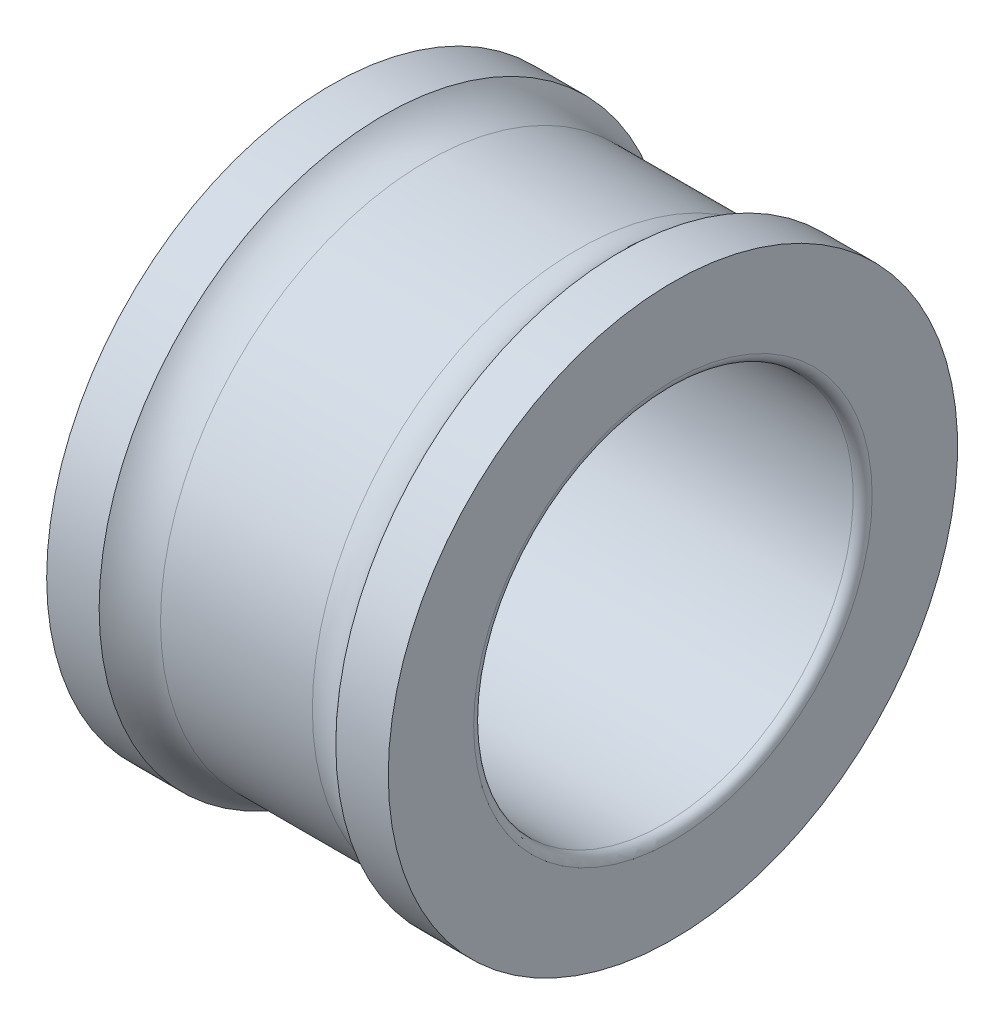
ISO-10303-21;
HEADER;
FILE_DESCRIPTION(('STEP AP214'),'2;1');
FILE_NAME('part.step','',(''),(''),'','','');
FILE_SCHEMA(('AUTOMOTIVE_DESIGN { 1 0 10303 214 1 1 1 1 }'));
ENDSEC;
DATA;
#1=APPLICATION_CONTEXT('core data for automotive mechanical design processes');
#2=APPLICATION_PROTOCOL_DEFINITION('international standard','automotive_design',2000,#1);
#3=PRODUCT_CONTEXT('',#1,'mechanical');
#4=PRODUCT('Part','Part','',(#3));
#5=PRODUCT_RELATED_PRODUCT_CATEGORY('part','',(#4));
#6=PRODUCT_DEFINITION_FORMATION('','',#4);
#7=PRODUCT_DEFINITION_CONTEXT('part definition',#1,'design');
#8=PRODUCT_DEFINITION('design','',#6,#7);
#9=PRODUCT_DEFINITION_SHAPE('','',#8);
#10=(LENGTH_UNIT() NAMED_UNIT(*) SI_UNIT(.MILLI.,.METRE.));
#11=(NAMED_UNIT(*) PLANE_ANGLE_UNIT() SI_UNIT($,.RADIAN.));
#12=(NAMED_UNIT(*) SI_UNIT($,.STERADIAN.) SOLID_ANGLE_UNIT());
#13=UNCERTAINTY_MEASURE_WITH_UNIT(LENGTH_MEASURE(1.E-05),#10,'distance_accuracy_value','');
#14=(GEOMETRIC_REPRESENTATION_CONTEXT(3) GLOBAL_UNCERTAINTY_ASSIGNED_CONTEXT((#13)) GLOBAL_UNIT_ASSIGNED_CONTEXT((#10,
#11,#12)) REPRESENTATION_CONTEXT('',''));
#15=CARTESIAN_POINT('',(0.,0.,0.));
#16=DIRECTION('',(0.,0.,1.));
#17=DIRECTION('',(1.,0.,0.));
#18=AXIS2_PLACEMENT_3D('',#15,#16,#17);
#19=CARTESIAN_POINT('',(-2.37741143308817,0.,0.));
#20=DIRECTION('',(-1.,0.,0.));
#21=DIRECTION('',(0.,0.,1.));
#22=AXIS2_PLACEMENT_3D('',#19,#20,#21);
#23=CYLINDRICAL_SURFACE('',#22,10.);
#24=CARTESIAN_POINT('',(0.5,0.,0.));
#25=DIRECTION('',(1.,0.,0.));
#26=DIRECTION('',(0.,0.,-1.));
#27=AXIS2_PLACEMENT_3D('',#24,#25,#26);
#28=CIRCLE('',#27,10.);
#29=CARTESIAN_POINT('',(0.5,0.,-10.));
#30=VERTEX_POINT('',#29);
#31=EDGE_CURVE('E41',#30,#30,#28,.F.);
#32=ORIENTED_EDGE('',*,*,#31,.T.);
#33=EDGE_LOOP('',(#32));
#34=FACE_BOUND('',#33,.T.);
#35=CARTESIAN_POINT('',(17.5,0.,0.));
#36=DIRECTION('',(-1.,0.,0.));
#37=DIRECTION('',(0.,0.,1.));
#38=AXIS2_PLACEMENT_3D('',#35,#36,#37);
#39=CIRCLE('',#38,10.);
#40=CARTESIAN_POINT('',(17.5,0.,10.));
#41=VERTEX_POINT('',#40);
#42=EDGE_CURVE('E45',#41,#41,#39,.F.);
#43=ORIENTED_EDGE('',*,*,#42,.T.);
#44=EDGE_LOOP('',(#43));
#45=FACE_BOUND('',#44,.T.);
#46=ADVANCED_FACE('F30',(#34,#45),#23,.F.);
#47=CARTESIAN_POINT('',(18.,15.,0.));
#48=DIRECTION('',(-1.,0.,0.));
#49=DIRECTION('',(0.,0.,1.));
#50=AXIS2_PLACEMENT_3D('',#47,#48,#49);
#51=PLANE('',#50);
#52=CARTESIAN_POINT('',(18.,0.,0.));
#53=DIRECTION('',(-1.,0.,0.));
#54=DIRECTION('',(0.,0.,1.));
#55=AXIS2_PLACEMENT_3D('',#52,#53,#54);
#56=CIRCLE('',#55,10.5);
#57=CARTESIAN_POINT('',(18.,0.,10.5));
#58=VERTEX_POINT('',#57);
#59=EDGE_CURVE('E10',#58,#58,#56,.T.);
#60=ORIENTED_EDGE('',*,*,#59,.T.);
#61=EDGE_LOOP('',(#60));
#62=FACE_BOUND('',#61,.T.);
#63=CARTESIAN_POINT('',(18.,0.,0.));
#64=DIRECTION('',(-1.,0.,0.));
#65=DIRECTION('',(0.,0.,1.));
#66=AXIS2_PLACEMENT_3D('',#63,#64,#65);
#67=CIRCLE('',#66,15.);
#68=CARTESIAN_POINT('',(18.,0.,15.));
#69=VERTEX_POINT('',#68);
#70=EDGE_CURVE('E50',#69,#69,#67,.T.);
#71=ORIENTED_EDGE('',*,*,#70,.F.);
#72=EDGE_LOOP('',(#71));
#73=FACE_BOUND('',#72,.T.);
#74=ADVANCED_FACE('F98',(#62,#73),#51,.F.);
#75=CARTESIAN_POINT('',(-2.37741143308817,0.,0.));
#76=DIRECTION('',(-1.,0.,0.));
#77=DIRECTION('',(0.,0.,1.));
#78=AXIS2_PLACEMENT_3D('',#75,#76,#77);
#79=CYLINDRICAL_SURFACE('',#78,15.);
#80=CARTESIAN_POINT('',(15.2360679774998,0.,0.));
#81=DIRECTION('',(-1.,0.,0.));
#82=DIRECTION('',(0.,0.,1.));
#83=AXIS2_PLACEMENT_3D('',#80,#81,#82);
#84=CIRCLE('',#83,15.);
#85=CARTESIAN_POINT('',(15.2360679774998,0.,15.));
#86=VERTEX_POINT('',#85);
#87=EDGE_CURVE('E53',#86,#86,#84,.T.);
#88=ORIENTED_EDGE('',*,*,#87,.F.);
#89=EDGE_LOOP('',(#88));
#90=FACE_BOUND('',#89,.T.);
#91=ORIENTED_EDGE('',*,*,#70,.T.);
#92=EDGE_LOOP('',(#91));
#93=FACE_BOUND('',#92,.T.);
#94=ADVANCED_FACE('F92',(#90,#93),#79,.T.);
#95=CARTESIAN_POINT('',(13.,0.,0.));
#96=DIRECTION('',(-1.,0.,0.));
#97=DIRECTION('',(0.,0.,1.));
#98=AXIS2_PLACEMENT_3D('',#95,#96,#97);
#99=TOROIDAL_SURFACE('',#98,17.,3.);
#100=CARTESIAN_POINT('',(13.,0.,0.));
#101=DIRECTION('',(-1.,0.,0.));
#102=DIRECTION('',(0.,0.,1.));
#103=AXIS2_PLACEMENT_3D('',#100,#101,#102);
#104=CIRCLE('',#103,14.);
#105=CARTESIAN_POINT('',(13.,0.,14.));
#106=VERTEX_POINT('',#105);
#107=EDGE_CURVE('E56',#106,#106,#104,.T.);
#108=ORIENTED_EDGE('',*,*,#107,.F.);
#109=EDGE_LOOP('',(#108));
#110=FACE_BOUND('',#109,.T.);
#111=ORIENTED_EDGE('',*,*,#87,.T.);
#112=EDGE_LOOP('',(#111));
#113=FACE_BOUND('',#112,.T.);
#114=ADVANCED_FACE('F86',(#110,#113),#99,.F.);
#115=CARTESIAN_POINT('',(-2.37741143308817,0.,0.));
#116=DIRECTION('',(-1.,0.,0.));
#117=DIRECTION('',(0.,0.,1.));
#118=AXIS2_PLACEMENT_3D('',#115,#116,#117);
#119=CYLINDRICAL_SURFACE('',#118,14.);
#120=CARTESIAN_POINT('',(5.,0.,0.));
#121=DIRECTION('',(-1.,0.,0.));
#122=DIRECTION('',(0.,0.,1.));
#123=AXIS2_PLACEMENT_3D('',#120,#121,#122);
#124=CIRCLE('',#123,14.);
#125=CARTESIAN_POINT('',(5.,0.,14.));
#126=VERTEX_POINT('',#125);
#127=EDGE_CURVE('E59',#126,#126,#124,.T.);
#128=ORIENTED_EDGE('',*,*,#127,.F.);
#129=EDGE_LOOP('',(#128));
#130=FACE_BOUND('',#129,.T.);
#131=ORIENTED_EDGE('',*,*,#107,.T.);
#132=EDGE_LOOP('',(#131));
#133=FACE_BOUND('',#132,.T.);
#134=ADVANCED_FACE('F80',(#130,#133),#119,.T.);
#135=CARTESIAN_POINT('',(5.,0.,0.));
#136=DIRECTION('',(-1.,0.,0.));
#137=DIRECTION('',(0.,0.,1.));
#138=AXIS2_PLACEMENT_3D('',#135,#136,#137);
#139=TOROIDAL_SURFACE('',#138,17.,3.);
#140=CARTESIAN_POINT('',(2.76393202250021,0.,0.));
#141=DIRECTION('',(-1.,0.,0.));
#142=DIRECTION('',(0.,0.,1.));
#143=AXIS2_PLACEMENT_3D('',#140,#141,#142);
#144=CIRCLE('',#143,15.);
#145=CARTESIAN_POINT('',(2.76393202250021,0.,15.));
#146=VERTEX_POINT('',#145);
#147=EDGE_CURVE('E62',#146,#146,#144,.T.);
#148=ORIENTED_EDGE('',*,*,#147,.F.);
#149=EDGE_LOOP('',(#148));
#150=FACE_BOUND('',#149,.T.);
#151=ORIENTED_EDGE('',*,*,#127,.T.);
#152=EDGE_LOOP('',(#151));
#153=FACE_BOUND('',#152,.T.);
#154=ADVANCED_FACE('F74',(#150,#153),#139,.F.);
#155=CARTESIAN_POINT('',(-2.37741143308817,0.,0.));
#156=DIRECTION('',(-1.,0.,0.));
#157=DIRECTION('',(0.,0.,1.));
#158=AXIS2_PLACEMENT_3D('',#155,#156,#157);
#159=CYLINDRICAL_SURFACE('',#158,15.);
#160=CARTESIAN_POINT('',(0.,0.,0.));
#161=DIRECTION('',(-1.,0.,0.));
#162=DIRECTION('',(0.,0.,1.));
#163=AXIS2_PLACEMENT_3D('',#160,#161,#162);
#164=CIRCLE('',#163,15.);
#165=CARTESIAN_POINT('',(0.,0.,15.));
#166=VERTEX_POINT('',#165);
#167=EDGE_CURVE('E65',#166,#166,#164,.T.);
#168=ORIENTED_EDGE('',*,*,#167,.F.);
#169=EDGE_LOOP('',(#168));
#170=FACE_BOUND('',#169,.T.);
#171=ORIENTED_EDGE('',*,*,#147,.T.);
#172=EDGE_LOOP('',(#171));
#173=FACE_BOUND('',#172,.T.);
#174=ADVANCED_FACE('F71',(#170,#173),#159,.T.);
#175=CARTESIAN_POINT('',(0.,10.,0.));
#176=DIRECTION('',(1.,0.,0.));
#177=DIRECTION('',(0.,0.,-1.));
#178=AXIS2_PLACEMENT_3D('',#175,#176,#177);
#179=PLANE('',#178);
#180=CARTESIAN_POINT('',(0.,0.,0.));
#181=DIRECTION('',(1.,0.,0.));
#182=DIRECTION('',(0.,0.,-1.));
#183=AXIS2_PLACEMENT_3D('',#180,#181,#182);
#184=CIRCLE('',#183,10.5);
#185=CARTESIAN_POINT('',(0.,0.,-10.5));
#186=VERTEX_POINT('',#185);
#187=EDGE_CURVE('E37',#186,#186,#184,.T.);
#188=ORIENTED_EDGE('',*,*,#187,.T.);
#189=EDGE_LOOP('',(#188));
#190=FACE_BOUND('',#189,.T.);
#191=ORIENTED_EDGE('',*,*,#167,.T.);
#192=EDGE_LOOP('',(#191));
#193=FACE_BOUND('',#192,.T.);
#194=ADVANCED_FACE('F69',(#190,#193),#179,.F.);
#195=CARTESIAN_POINT('',(0.5,0.,0.));
#196=DIRECTION('',(1.,0.,0.));
#197=DIRECTION('',(0.,0.,-1.));
#198=AXIS2_PLACEMENT_3D('',#195,#196,#197);
#199=TOROIDAL_SURFACE('',#198,10.5,0.5);
#200=ORIENTED_EDGE('',*,*,#187,.F.);
#201=EDGE_LOOP('',(#200));
#202=FACE_BOUND('',#201,.T.);
#203=ORIENTED_EDGE('',*,*,#31,.F.);
#204=EDGE_LOOP('',(#203));
#205=FACE_BOUND('',#204,.T.);
#206=ADVANCED_FACE('F109',(#202,#205),#199,.T.);
#207=CARTESIAN_POINT('',(17.5,0.,0.));
#208=DIRECTION('',(-1.,0.,0.));
#209=DIRECTION('',(0.,0.,1.));
#210=AXIS2_PLACEMENT_3D('',#207,#208,#209);
#211=TOROIDAL_SURFACE('',#210,10.5,0.5);
#212=ORIENTED_EDGE('',*,*,#42,.F.);
#213=EDGE_LOOP('',(#212));
#214=FACE_BOUND('',#213,.T.);
#215=ORIENTED_EDGE('',*,*,#59,.F.);
#216=EDGE_LOOP('',(#215));
#217=FACE_BOUND('',#216,.T.);
#218=ADVANCED_FACE('F32',(#214,#217),#211,.T.);
#219=CLOSED_SHELL('',(#46,#74,#94,#114,#134,#154,#174,#194,#206,#218));
#220=MANIFOLD_SOLID_BREP('B2',#219);
#221=ADVANCED_BREP_SHAPE_REPRESENTATION('',(#18,#220),#14);
#222=SHAPE_DEFINITION_REPRESENTATION(#9,#221);
ENDSEC;
END-ISO-10303-21;
